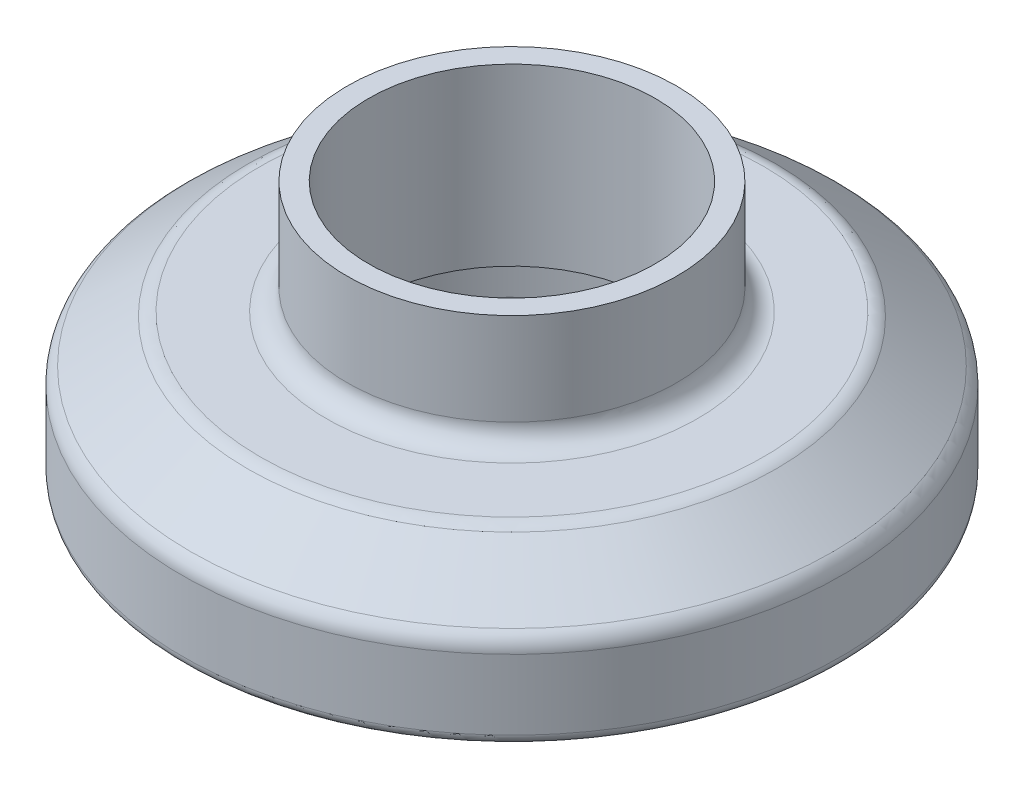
ISO-10303-21;
HEADER;
FILE_DESCRIPTION(('STEP AP214'),'2;1');
FILE_NAME('part.step','',(''),(''),'','','');
FILE_SCHEMA(('AUTOMOTIVE_DESIGN { 1 0 10303 214 1 1 1 1 }'));
ENDSEC;
DATA;
#1=APPLICATION_CONTEXT('core data for automotive mechanical design processes');
#2=APPLICATION_PROTOCOL_DEFINITION('international standard','automotive_design',2000,#1);
#3=PRODUCT_CONTEXT('',#1,'mechanical');
#4=PRODUCT('Part','Part','',(#3));
#5=PRODUCT_RELATED_PRODUCT_CATEGORY('part','',(#4));
#6=PRODUCT_DEFINITION_FORMATION('','',#4);
#7=PRODUCT_DEFINITION_CONTEXT('part definition',#1,'design');
#8=PRODUCT_DEFINITION('design','',#6,#7);
#9=PRODUCT_DEFINITION_SHAPE('','',#8);
#10=(LENGTH_UNIT() NAMED_UNIT(*) SI_UNIT(.MILLI.,.METRE.));
#11=(NAMED_UNIT(*) PLANE_ANGLE_UNIT() SI_UNIT($,.RADIAN.));
#12=(NAMED_UNIT(*) SI_UNIT($,.STERADIAN.) SOLID_ANGLE_UNIT());
#13=UNCERTAINTY_MEASURE_WITH_UNIT(LENGTH_MEASURE(1.E-05),#10,'distance_accuracy_value','');
#14=(GEOMETRIC_REPRESENTATION_CONTEXT(3) GLOBAL_UNCERTAINTY_ASSIGNED_CONTEXT((#13)) GLOBAL_UNIT_ASSIGNED_CONTEXT((#10,
#11,#12)) REPRESENTATION_CONTEXT('',''));
#15=CARTESIAN_POINT('',(0.,0.,0.));
#16=DIRECTION('',(0.,0.,1.));
#17=DIRECTION('',(1.,0.,0.));
#18=AXIS2_PLACEMENT_3D('',#15,#16,#17);
#19=CARTESIAN_POINT('',(0.,0.,0.));
#20=DIRECTION('',(0.,-1.,0.));
#21=DIRECTION('',(0.,0.,-1.));
#22=AXIS2_PLACEMENT_3D('',#19,#20,#21);
#23=CYLINDRICAL_SURFACE('',#22,11.049);
#24=CARTESIAN_POINT('',(0.,19.8374,0.));
#25=DIRECTION('',(0.,-1.,0.));
#26=DIRECTION('',(0.,0.,-1.));
#27=AXIS2_PLACEMENT_3D('',#24,#25,#26);
#28=CIRCLE('',#27,11.049);
#29=CARTESIAN_POINT('',(0.,19.8374,-11.049));
#30=VERTEX_POINT('',#29);
#31=EDGE_CURVE('E12',#30,#30,#28,.T.);
#32=ORIENTED_EDGE('',*,*,#31,.F.);
#33=EDGE_LOOP('',(#32));
#34=FACE_BOUND('',#33,.T.);
#35=CARTESIAN_POINT('',(0.,6.35,0.));
#36=DIRECTION('',(0.,-1.,0.));
#37=DIRECTION('',(0.,0.,-1.));
#38=AXIS2_PLACEMENT_3D('',#35,#36,#37);
#39=CIRCLE('',#38,11.049);
#40=CARTESIAN_POINT('',(0.,6.35,-11.049));
#41=VERTEX_POINT('',#40);
#42=EDGE_CURVE('E87',#41,#41,#39,.T.);
#43=ORIENTED_EDGE('',*,*,#42,.T.);
#44=EDGE_LOOP('',(#43));
#45=FACE_BOUND('',#44,.T.);
#46=ADVANCED_FACE('F38',(#34,#45),#23,.F.);
#47=CARTESIAN_POINT('',(-11.049,19.8374,0.));
#48=DIRECTION('',(0.,-1.,0.));
#49=DIRECTION('',(0.,0.,-1.));
#50=AXIS2_PLACEMENT_3D('',#47,#48,#49);
#51=PLANE('',#50);
#52=CARTESIAN_POINT('',(0.,19.8374,0.));
#53=DIRECTION('',(0.,-1.,0.));
#54=DIRECTION('',(0.,0.,-1.));
#55=AXIS2_PLACEMENT_3D('',#52,#53,#54);
#56=CIRCLE('',#55,12.7);
#57=CARTESIAN_POINT('',(0.,19.8374,-12.7));
#58=VERTEX_POINT('',#57);
#59=EDGE_CURVE('E44',#58,#58,#56,.T.);
#60=ORIENTED_EDGE('',*,*,#59,.F.);
#61=EDGE_LOOP('',(#60));
#62=FACE_BOUND('',#61,.T.);
#63=ORIENTED_EDGE('',*,*,#31,.T.);
#64=EDGE_LOOP('',(#63));
#65=FACE_BOUND('',#64,.T.);
#66=ADVANCED_FACE('F166',(#62,#65),#51,.F.);
#67=CARTESIAN_POINT('',(0.,0.,0.));
#68=DIRECTION('',(0.,-1.,0.));
#69=DIRECTION('',(0.,0.,-1.));
#70=AXIS2_PLACEMENT_3D('',#67,#68,#69);
#71=CYLINDRICAL_SURFACE('',#70,12.7);
#72=CARTESIAN_POINT('',(0.,12.7254,0.));
#73=DIRECTION('',(0.,-1.,0.));
#74=DIRECTION('',(0.,0.,-1.));
#75=AXIS2_PLACEMENT_3D('',#72,#73,#74);
#76=CIRCLE('',#75,12.7);
#77=CARTESIAN_POINT('',(0.,12.7254,-12.7));
#78=VERTEX_POINT('',#77);
#79=EDGE_CURVE('E48',#78,#78,#76,.T.);
#80=ORIENTED_EDGE('',*,*,#79,.F.);
#81=EDGE_LOOP('',(#80));
#82=FACE_BOUND('',#81,.T.);
#83=ORIENTED_EDGE('',*,*,#59,.T.);
#84=EDGE_LOOP('',(#83));
#85=FACE_BOUND('',#84,.T.);
#86=ADVANCED_FACE('F161',(#82,#85),#71,.T.);
#87=CARTESIAN_POINT('',(0.,12.7254,0.));
#88=DIRECTION('',(0.,-1.,0.));
#89=DIRECTION('',(0.,0.,-1.));
#90=AXIS2_PLACEMENT_3D('',#87,#88,#89);
#91=TOROIDAL_SURFACE('',#90,14.3002,1.6002);
#92=CARTESIAN_POINT('',(0.,11.1252,0.));
#93=DIRECTION('',(0.,-1.,0.));
#94=DIRECTION('',(0.,0.,-1.));
#95=AXIS2_PLACEMENT_3D('',#92,#93,#94);
#96=CIRCLE('',#95,14.3002);
#97=CARTESIAN_POINT('',(0.,11.1252,-14.3002));
#98=VERTEX_POINT('',#97);
#99=EDGE_CURVE('E52',#98,#98,#96,.T.);
#100=ORIENTED_EDGE('',*,*,#99,.F.);
#101=EDGE_LOOP('',(#100));
#102=FACE_BOUND('',#101,.T.);
#103=ORIENTED_EDGE('',*,*,#79,.T.);
#104=EDGE_LOOP('',(#103));
#105=FACE_BOUND('',#104,.T.);
#106=ADVANCED_FACE('F155',(#102,#105),#91,.F.);
#107=CARTESIAN_POINT('',(-14.3002,11.1251999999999,0.));
#108=DIRECTION('',(0.,-1.,0.));
#109=DIRECTION('',(0.,0.,-1.));
#110=AXIS2_PLACEMENT_3D('',#107,#108,#109);
#111=PLANE('',#110);
#112=CARTESIAN_POINT('',(0.,11.1252,0.));
#113=DIRECTION('',(0.,-1.,0.));
#114=DIRECTION('',(0.,0.,-1.));
#115=AXIS2_PLACEMENT_3D('',#112,#113,#114);
#116=CIRCLE('',#115,19.3967275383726);
#117=CARTESIAN_POINT('',(0.,11.1252,-19.3967275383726));
#118=VERTEX_POINT('',#117);
#119=EDGE_CURVE('E57',#118,#118,#116,.T.);
#120=ORIENTED_EDGE('',*,*,#119,.F.);
#121=EDGE_LOOP('',(#120));
#122=FACE_BOUND('',#121,.T.);
#123=ORIENTED_EDGE('',*,*,#99,.T.);
#124=EDGE_LOOP('',(#123));
#125=FACE_BOUND('',#124,.T.);
#126=ADVANCED_FACE('F149',(#122,#125),#111,.F.);
#127=CARTESIAN_POINT('',(0.,9.525,0.));
#128=DIRECTION('',(0.,-1.,0.));
#129=DIRECTION('',(0.,0.,-1.));
#130=AXIS2_PLACEMENT_3D('',#127,#128,#129);
#131=TOROIDAL_SURFACE('',#130,19.3967275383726,1.6002);
#132=CARTESIAN_POINT('',(0.,10.8029765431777,0.));
#133=DIRECTION('',(0.,-1.,0.));
#134=DIRECTION('',(0.,0.,-1.));
#135=AXIS2_PLACEMENT_3D('',#132,#133,#134);
#136=CIRCLE('',#135,20.3597519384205);
#137=CARTESIAN_POINT('',(0.,10.8029765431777,-20.3597519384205));
#138=VERTEX_POINT('',#137);
#139=EDGE_CURVE('E60',#138,#138,#136,.T.);
#140=ORIENTED_EDGE('',*,*,#139,.F.);
#141=EDGE_LOOP('',(#140));
#142=FACE_BOUND('',#141,.T.);
#143=ORIENTED_EDGE('',*,*,#119,.T.);
#144=EDGE_LOOP('',(#143));
#145=FACE_BOUND('',#144,.T.);
#146=ADVANCED_FACE('F143',(#142,#145),#131,.T.);
#147=CARTESIAN_POINT('',(0.,10.8029765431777,0.));
#148=DIRECTION('',(0.,-1.,0.));
#149=DIRECTION('',(0.,0.,-1.));
#150=AXIS2_PLACEMENT_3D('',#147,#148,#149);
#151=CONICAL_SURFACE('',#150,20.3597519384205,0.925024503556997);
#152=CARTESIAN_POINT('',(0.,7.48502345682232,0.));
#153=DIRECTION('',(0.,-1.,0.));
#154=DIRECTION('',(0.,0.,-1.));
#155=AXIS2_PLACEMENT_3D('',#152,#153,#154);
#156=CIRCLE('',#155,24.7628244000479);
#157=CARTESIAN_POINT('',(0.,7.48502345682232,-24.7628244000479));
#158=VERTEX_POINT('',#157);
#159=EDGE_CURVE('E63',#158,#158,#156,.T.);
#160=ORIENTED_EDGE('',*,*,#159,.F.);
#161=EDGE_LOOP('',(#160));
#162=FACE_BOUND('',#161,.T.);
#163=ORIENTED_EDGE('',*,*,#139,.T.);
#164=EDGE_LOOP('',(#163));
#165=FACE_BOUND('',#164,.T.);
#166=ADVANCED_FACE('F137',(#162,#165),#151,.T.);
#167=CARTESIAN_POINT('',(0.,6.20704691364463,0.));
#168=DIRECTION('',(0.,-1.,0.));
#169=DIRECTION('',(0.,0.,-1.));
#170=AXIS2_PLACEMENT_3D('',#167,#168,#169);
#171=TOROIDAL_SURFACE('',#170,23.7998,1.6002);
#172=CARTESIAN_POINT('',(0.,6.20704691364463,0.));
#173=DIRECTION('',(0.,-1.,0.));
#174=DIRECTION('',(0.,0.,-1.));
#175=AXIS2_PLACEMENT_3D('',#172,#173,#174);
#176=CIRCLE('',#175,25.4);
#177=CARTESIAN_POINT('',(0.,6.20704691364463,-25.4));
#178=VERTEX_POINT('',#177);
#179=EDGE_CURVE('E66',#178,#178,#176,.T.);
#180=ORIENTED_EDGE('',*,*,#179,.F.);
#181=EDGE_LOOP('',(#180));
#182=FACE_BOUND('',#181,.T.);
#183=ORIENTED_EDGE('',*,*,#159,.T.);
#184=EDGE_LOOP('',(#183));
#185=FACE_BOUND('',#184,.T.);
#186=ADVANCED_FACE('F131',(#182,#185),#171,.T.);
#187=CARTESIAN_POINT('',(0.,0.,0.));
#188=DIRECTION('',(0.,-1.,0.));
#189=DIRECTION('',(0.,0.,-1.));
#190=AXIS2_PLACEMENT_3D('',#187,#188,#189);
#191=CYLINDRICAL_SURFACE('',#190,25.4);
#192=CARTESIAN_POINT('',(0.,0.812800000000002,0.));
#193=DIRECTION('',(0.,-1.,0.));
#194=DIRECTION('',(0.,0.,-1.));
#195=AXIS2_PLACEMENT_3D('',#192,#193,#194);
#196=CIRCLE('',#195,25.4);
#197=CARTESIAN_POINT('',(0.,0.812800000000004,-25.4));
#198=VERTEX_POINT('',#197);
#199=EDGE_CURVE('E69',#198,#198,#196,.T.);
#200=ORIENTED_EDGE('',*,*,#199,.F.);
#201=EDGE_LOOP('',(#200));
#202=FACE_BOUND('',#201,.T.);
#203=ORIENTED_EDGE('',*,*,#179,.T.);
#204=EDGE_LOOP('',(#203));
#205=FACE_BOUND('',#204,.T.);
#206=ADVANCED_FACE('F125',(#202,#205),#191,.T.);
#207=CARTESIAN_POINT('',(0.,0.812800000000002,0.));
#208=DIRECTION('',(0.,-1.,0.));
#209=DIRECTION('',(0.,0.,-1.));
#210=AXIS2_PLACEMENT_3D('',#207,#208,#209);
#211=TOROIDAL_SURFACE('',#210,24.5872,0.8128);
#212=CARTESIAN_POINT('',(0.,0.,0.));
#213=DIRECTION('',(0.,-1.,0.));
#214=DIRECTION('',(0.,0.,-1.));
#215=AXIS2_PLACEMENT_3D('',#212,#213,#214);
#216=CIRCLE('',#215,24.5872);
#217=CARTESIAN_POINT('',(0.,0.,-24.5872));
#218=VERTEX_POINT('',#217);
#219=EDGE_CURVE('E72',#218,#218,#216,.T.);
#220=ORIENTED_EDGE('',*,*,#219,.F.);
#221=EDGE_LOOP('',(#220));
#222=FACE_BOUND('',#221,.T.);
#223=ORIENTED_EDGE('',*,*,#199,.T.);
#224=EDGE_LOOP('',(#223));
#225=FACE_BOUND('',#224,.T.);
#226=ADVANCED_FACE('F119',(#222,#225),#211,.T.);
#227=CARTESIAN_POINT('',(-24.5872,0.,0.));
#228=DIRECTION('',(0.,1.,0.));
#229=DIRECTION('',(0.,0.,1.));
#230=AXIS2_PLACEMENT_3D('',#227,#228,#229);
#231=PLANE('',#230);
#232=CARTESIAN_POINT('',(0.,0.,0.));
#233=DIRECTION('',(0.,-1.,0.));
#234=DIRECTION('',(0.,0.,-1.));
#235=AXIS2_PLACEMENT_3D('',#232,#233,#234);
#236=CIRCLE('',#235,16.764);
#237=CARTESIAN_POINT('',(0.,0.,-16.764));
#238=VERTEX_POINT('',#237);
#239=EDGE_CURVE('E75',#238,#238,#236,.T.);
#240=ORIENTED_EDGE('',*,*,#239,.F.);
#241=EDGE_LOOP('',(#240));
#242=FACE_BOUND('',#241,.T.);
#243=ORIENTED_EDGE('',*,*,#219,.T.);
#244=EDGE_LOOP('',(#243));
#245=FACE_BOUND('',#244,.T.);
#246=ADVANCED_FACE('F113',(#242,#245),#231,.F.);
#247=CARTESIAN_POINT('',(0.,0.812800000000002,0.));
#248=DIRECTION('',(0.,-1.,0.));
#249=DIRECTION('',(0.,0.,-1.));
#250=AXIS2_PLACEMENT_3D('',#247,#248,#249);
#251=TOROIDAL_SURFACE('',#250,16.764,0.8128);
#252=CARTESIAN_POINT('',(0.,0.812800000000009,0.));
#253=DIRECTION('',(0.,-1.,0.));
#254=DIRECTION('',(0.,0.,-1.));
#255=AXIS2_PLACEMENT_3D('',#252,#253,#254);
#256=CIRCLE('',#255,15.9512);
#257=CARTESIAN_POINT('',(0.,0.81280000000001,-15.9512));
#258=VERTEX_POINT('',#257);
#259=EDGE_CURVE('E78',#258,#258,#256,.T.);
#260=ORIENTED_EDGE('',*,*,#259,.F.);
#261=EDGE_LOOP('',(#260));
#262=FACE_BOUND('',#261,.T.);
#263=ORIENTED_EDGE('',*,*,#239,.T.);
#264=EDGE_LOOP('',(#263));
#265=FACE_BOUND('',#264,.T.);
#266=ADVANCED_FACE('F107',(#262,#265),#251,.T.);
#267=CARTESIAN_POINT('',(0.,0.,0.));
#268=DIRECTION('',(0.,-1.,0.));
#269=DIRECTION('',(0.,0.,-1.));
#270=AXIS2_PLACEMENT_3D('',#267,#268,#269);
#271=CYLINDRICAL_SURFACE('',#270,15.9512);
#272=CARTESIAN_POINT('',(0.,5.53719999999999,0.));
#273=DIRECTION('',(0.,-1.,0.));
#274=DIRECTION('',(0.,0.,-1.));
#275=AXIS2_PLACEMENT_3D('',#272,#273,#274);
#276=CIRCLE('',#275,15.9512);
#277=CARTESIAN_POINT('',(0.,5.53719999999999,-15.9512));
#278=VERTEX_POINT('',#277);
#279=EDGE_CURVE('E81',#278,#278,#276,.T.);
#280=ORIENTED_EDGE('',*,*,#279,.F.);
#281=EDGE_LOOP('',(#280));
#282=FACE_BOUND('',#281,.T.);
#283=ORIENTED_EDGE('',*,*,#259,.T.);
#284=EDGE_LOOP('',(#283));
#285=FACE_BOUND('',#284,.T.);
#286=ADVANCED_FACE('F101',(#282,#285),#271,.F.);
#287=CARTESIAN_POINT('',(0.,5.5372,0.));
#288=DIRECTION('',(0.,-1.,0.));
#289=DIRECTION('',(0.,0.,-1.));
#290=AXIS2_PLACEMENT_3D('',#287,#288,#289);
#291=TOROIDAL_SURFACE('',#290,15.1384,0.8128);
#292=CARTESIAN_POINT('',(0.,6.35,0.));
#293=DIRECTION('',(0.,-1.,0.));
#294=DIRECTION('',(0.,0.,-1.));
#295=AXIS2_PLACEMENT_3D('',#292,#293,#294);
#296=CIRCLE('',#295,15.1384);
#297=CARTESIAN_POINT('',(0.,6.35,-15.1384));
#298=VERTEX_POINT('',#297);
#299=EDGE_CURVE('E84',#298,#298,#296,.T.);
#300=ORIENTED_EDGE('',*,*,#299,.F.);
#301=EDGE_LOOP('',(#300));
#302=FACE_BOUND('',#301,.T.);
#303=ORIENTED_EDGE('',*,*,#279,.T.);
#304=EDGE_LOOP('',(#303));
#305=FACE_BOUND('',#304,.T.);
#306=ADVANCED_FACE('F95',(#302,#305),#291,.F.);
#307=CARTESIAN_POINT('',(-15.1384,6.3499999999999,0.));
#308=DIRECTION('',(0.,1.,0.));
#309=DIRECTION('',(0.,0.,1.));
#310=AXIS2_PLACEMENT_3D('',#307,#308,#309);
#311=PLANE('',#310);
#312=ORIENTED_EDGE('',*,*,#42,.F.);
#313=EDGE_LOOP('',(#312));
#314=FACE_BOUND('',#313,.T.);
#315=ORIENTED_EDGE('',*,*,#299,.T.);
#316=EDGE_LOOP('',(#315));
#317=FACE_BOUND('',#316,.T.);
#318=ADVANCED_FACE('F92',(#314,#317),#311,.F.);
#319=CLOSED_SHELL('',(#46,#66,#86,#106,#126,#146,#166,#186,#206,#226,#246,#266,#286,#306,#318));
#320=MANIFOLD_SOLID_BREP('B2',#319);
#321=ADVANCED_BREP_SHAPE_REPRESENTATION('',(#18,#320),#14);
#322=SHAPE_DEFINITION_REPRESENTATION(#9,#321);
ENDSEC;
END-ISO-10303-21;
